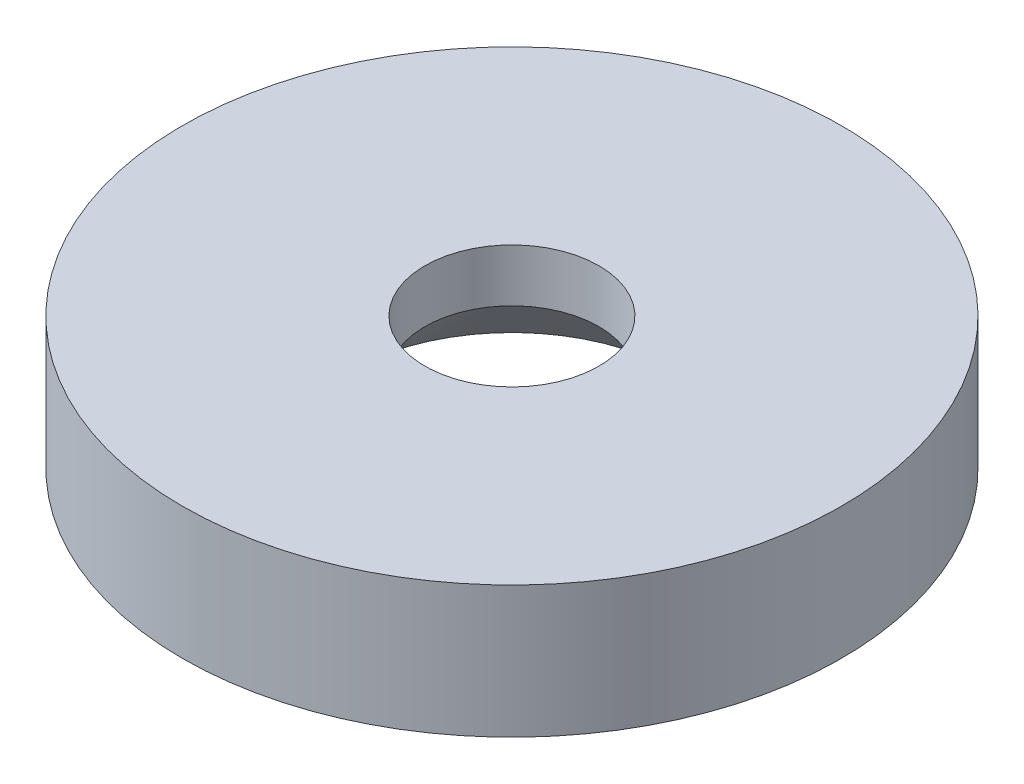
ISO-10303-21;
HEADER;
FILE_DESCRIPTION(('STEP AP214'),'2;1');
FILE_NAME('part.step','',(''),(''),'','','');
FILE_SCHEMA(('AUTOMOTIVE_DESIGN { 1 0 10303 214 1 1 1 1 }'));
ENDSEC;
DATA;
#1=APPLICATION_CONTEXT('core data for automotive mechanical design processes');
#2=APPLICATION_PROTOCOL_DEFINITION('international standard','automotive_design',2000,#1);
#3=PRODUCT_CONTEXT('',#1,'mechanical');
#4=PRODUCT('Part','Part','',(#3));
#5=PRODUCT_RELATED_PRODUCT_CATEGORY('part','',(#4));
#6=PRODUCT_DEFINITION_FORMATION('','',#4);
#7=PRODUCT_DEFINITION_CONTEXT('part definition',#1,'design');
#8=PRODUCT_DEFINITION('design','',#6,#7);
#9=PRODUCT_DEFINITION_SHAPE('','',#8);
#10=(LENGTH_UNIT() NAMED_UNIT(*) SI_UNIT(.MILLI.,.METRE.));
#11=(NAMED_UNIT(*) PLANE_ANGLE_UNIT() SI_UNIT($,.RADIAN.));
#12=(NAMED_UNIT(*) SI_UNIT($,.STERADIAN.) SOLID_ANGLE_UNIT());
#13=UNCERTAINTY_MEASURE_WITH_UNIT(LENGTH_MEASURE(1.E-05),#10,'distance_accuracy_value','');
#14=(GEOMETRIC_REPRESENTATION_CONTEXT(3) GLOBAL_UNCERTAINTY_ASSIGNED_CONTEXT((#13)) GLOBAL_UNIT_ASSIGNED_CONTEXT((#10,
#11,#12)) REPRESENTATION_CONTEXT('',''));
#15=CARTESIAN_POINT('',(0.,0.,0.));
#16=DIRECTION('',(0.,0.,1.));
#17=DIRECTION('',(1.,0.,0.));
#18=AXIS2_PLACEMENT_3D('',#15,#16,#17);
#19=CARTESIAN_POINT('',(0.,5.,0.));
#20=DIRECTION('',(0.,-1.,0.));
#21=DIRECTION('',(0.,0.,-1.));
#22=AXIS2_PLACEMENT_3D('',#19,#20,#21);
#23=CYLINDRICAL_SURFACE('',#22,12.5);
#24=CARTESIAN_POINT('',(0.,5.,0.));
#25=DIRECTION('',(0.,1.,0.));
#26=DIRECTION('',(0.,0.,1.));
#27=AXIS2_PLACEMENT_3D('',#24,#25,#26);
#28=CIRCLE('',#27,12.5);
#29=CARTESIAN_POINT('',(0.,5.,12.5));
#30=VERTEX_POINT('',#29);
#31=EDGE_CURVE('E10',#30,#30,#28,.T.);
#32=ORIENTED_EDGE('',*,*,#31,.F.);
#33=EDGE_LOOP('',(#32));
#34=FACE_BOUND('',#33,.T.);
#35=CARTESIAN_POINT('',(0.,0.,0.));
#36=DIRECTION('',(0.,1.,0.));
#37=DIRECTION('',(0.,0.,1.));
#38=AXIS2_PLACEMENT_3D('',#35,#36,#37);
#39=CIRCLE('',#38,12.5);
#40=CARTESIAN_POINT('',(0.,0.,12.5));
#41=VERTEX_POINT('',#40);
#42=EDGE_CURVE('E37',#41,#41,#39,.T.);
#43=ORIENTED_EDGE('',*,*,#42,.T.);
#44=EDGE_LOOP('',(#43));
#45=FACE_BOUND('',#44,.T.);
#46=ADVANCED_FACE('F34',(#34,#45),#23,.T.);
#47=CARTESIAN_POINT('',(0.,5.,0.));
#48=DIRECTION('',(0.,1.,0.));
#49=DIRECTION('',(0.,0.,1.));
#50=AXIS2_PLACEMENT_3D('',#47,#48,#49);
#51=PLANE('',#50);
#52=CARTESIAN_POINT('',(0.,5.,0.));
#53=DIRECTION('',(0.,-1.,0.));
#54=DIRECTION('',(0.,0.,-1.));
#55=AXIS2_PLACEMENT_3D('',#52,#53,#54);
#56=CIRCLE('',#55,3.3);
#57=CARTESIAN_POINT('',(0.,5.,-3.3));
#58=VERTEX_POINT('',#57);
#59=EDGE_CURVE('E44',#58,#58,#56,.T.);
#60=ORIENTED_EDGE('',*,*,#59,.T.);
#61=EDGE_LOOP('',(#60));
#62=FACE_BOUND('',#61,.T.);
#63=ORIENTED_EDGE('',*,*,#31,.T.);
#64=EDGE_LOOP('',(#63));
#65=FACE_BOUND('',#64,.T.);
#66=ADVANCED_FACE('F61',(#62,#65),#51,.T.);
#67=CARTESIAN_POINT('',(0.,0.,0.));
#68=DIRECTION('',(0.,1.,0.));
#69=DIRECTION('',(0.,0.,1.));
#70=AXIS2_PLACEMENT_3D('',#67,#68,#69);
#71=PLANE('',#70);
#72=CARTESIAN_POINT('',(0.,0.,0.));
#73=DIRECTION('',(0.,-1.,0.));
#74=DIRECTION('',(0.,0.,-1.));
#75=AXIS2_PLACEMENT_3D('',#72,#73,#74);
#76=CIRCLE('',#75,6.3);
#77=CARTESIAN_POINT('',(0.,0.,-6.3));
#78=VERTEX_POINT('',#77);
#79=EDGE_CURVE('E51',#78,#78,#76,.T.);
#80=ORIENTED_EDGE('',*,*,#79,.F.);
#81=EDGE_LOOP('',(#80));
#82=FACE_BOUND('',#81,.T.);
#83=ORIENTED_EDGE('',*,*,#42,.F.);
#84=EDGE_LOOP('',(#83));
#85=FACE_BOUND('',#84,.T.);
#86=ADVANCED_FACE('F57',(#82,#85),#71,.F.);
#87=CARTESIAN_POINT('',(0.,0.,0.));
#88=DIRECTION('',(0.,-1.,0.));
#89=DIRECTION('',(0.,0.,-1.));
#90=AXIS2_PLACEMENT_3D('',#87,#88,#89);
#91=CYLINDRICAL_SURFACE('',#90,3.3);
#92=ORIENTED_EDGE('',*,*,#59,.F.);
#93=EDGE_LOOP('',(#92));
#94=FACE_BOUND('',#93,.T.);
#95=CARTESIAN_POINT('',(0.,3.,0.));
#96=DIRECTION('',(0.,-1.,0.));
#97=DIRECTION('',(0.,0.,-1.));
#98=AXIS2_PLACEMENT_3D('',#95,#96,#97);
#99=CIRCLE('',#98,3.3);
#100=CARTESIAN_POINT('',(0.,3.,-3.3));
#101=VERTEX_POINT('',#100);
#102=EDGE_CURVE('E48',#101,#101,#99,.T.);
#103=ORIENTED_EDGE('',*,*,#102,.T.);
#104=EDGE_LOOP('',(#103));
#105=FACE_BOUND('',#104,.T.);
#106=ADVANCED_FACE('F60',(#94,#105),#91,.F.);
#107=CARTESIAN_POINT('',(0.,0.,0.));
#108=DIRECTION('',(0.,-1.,0.));
#109=DIRECTION('',(0.,0.,-1.));
#110=AXIS2_PLACEMENT_3D('',#107,#108,#109);
#111=CONICAL_SURFACE('',#110,6.3,0.785398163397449);
#112=ORIENTED_EDGE('',*,*,#102,.F.);
#113=EDGE_LOOP('',(#112));
#114=FACE_BOUND('',#113,.T.);
#115=ORIENTED_EDGE('',*,*,#79,.T.);
#116=EDGE_LOOP('',(#115));
#117=FACE_BOUND('',#116,.T.);
#118=ADVANCED_FACE('F55',(#114,#117),#111,.F.);
#119=CLOSED_SHELL('',(#46,#66,#86,#106,#118));
#120=MANIFOLD_SOLID_BREP('B2',#119);
#121=ADVANCED_BREP_SHAPE_REPRESENTATION('',(#18,#120),#14);
#122=SHAPE_DEFINITION_REPRESENTATION(#9,#121);
ENDSEC;
END-ISO-10303-21;
